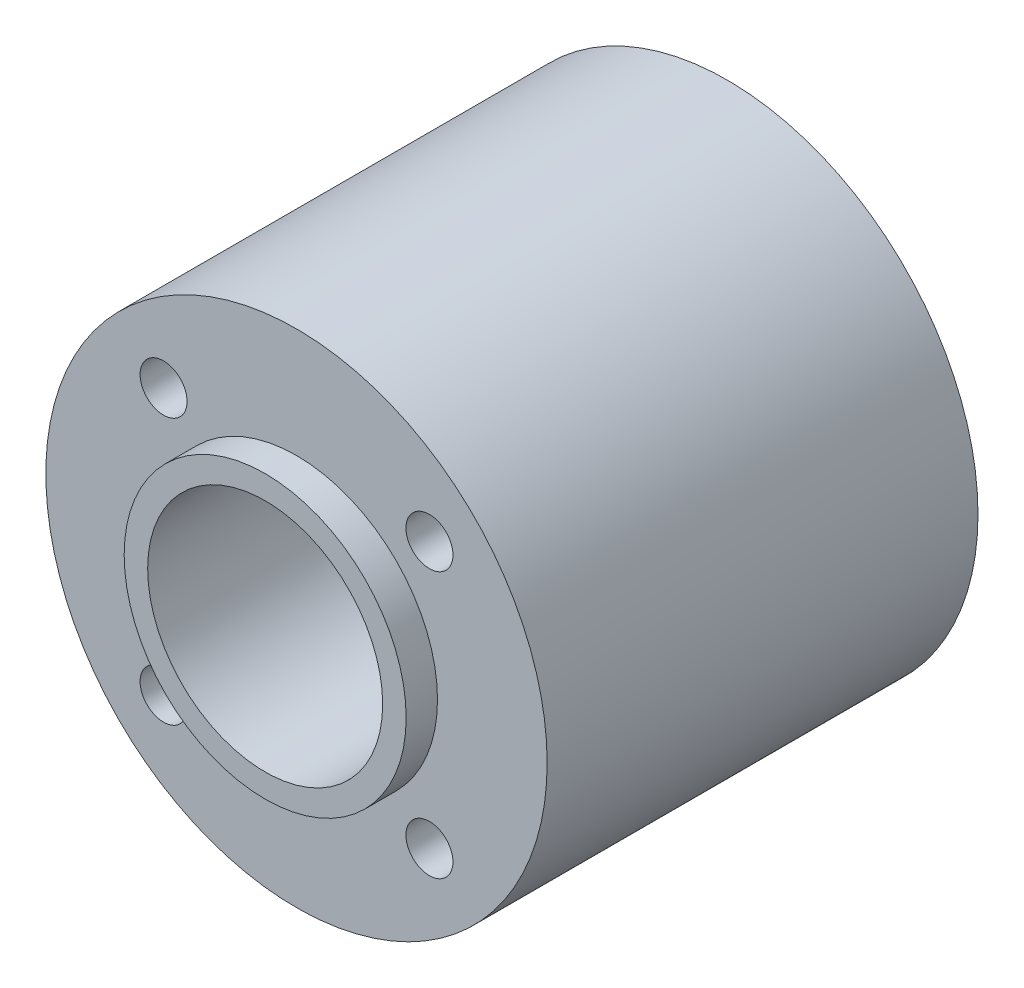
ISO-10303-21;
HEADER;
FILE_DESCRIPTION(('STEP AP214'),'2;1');
FILE_NAME('part.step','',(''),(''),'','','');
FILE_SCHEMA(('AUTOMOTIVE_DESIGN { 1 0 10303 214 1 1 1 1 }'));
ENDSEC;
DATA;
#1=APPLICATION_CONTEXT('core data for automotive mechanical design processes');
#2=APPLICATION_PROTOCOL_DEFINITION('international standard','automotive_design',2000,#1);
#3=PRODUCT_CONTEXT('',#1,'mechanical');
#4=PRODUCT('Part','Part','',(#3));
#5=PRODUCT_RELATED_PRODUCT_CATEGORY('part','',(#4));
#6=PRODUCT_DEFINITION_FORMATION('','',#4);
#7=PRODUCT_DEFINITION_CONTEXT('part definition',#1,'design');
#8=PRODUCT_DEFINITION('design','',#6,#7);
#9=PRODUCT_DEFINITION_SHAPE('','',#8);
#10=(LENGTH_UNIT() NAMED_UNIT(*) SI_UNIT(.MILLI.,.METRE.));
#11=(NAMED_UNIT(*) PLANE_ANGLE_UNIT() SI_UNIT($,.RADIAN.));
#12=(NAMED_UNIT(*) SI_UNIT($,.STERADIAN.) SOLID_ANGLE_UNIT());
#13=UNCERTAINTY_MEASURE_WITH_UNIT(LENGTH_MEASURE(1.E-05),#10,'distance_accuracy_value','');
#14=(GEOMETRIC_REPRESENTATION_CONTEXT(3) GLOBAL_UNCERTAINTY_ASSIGNED_CONTEXT((#13)) GLOBAL_UNIT_ASSIGNED_CONTEXT((#10,
#11,#12)) REPRESENTATION_CONTEXT('',''));
#15=CARTESIAN_POINT('',(0.,0.,0.));
#16=DIRECTION('',(0.,0.,1.));
#17=DIRECTION('',(1.,0.,0.));
#18=AXIS2_PLACEMENT_3D('',#15,#16,#17);
#19=CARTESIAN_POINT('',(0.,0.,13.75));
#20=DIRECTION('',(0.,0.,1.));
#21=DIRECTION('',(1.,0.,0.));
#22=AXIS2_PLACEMENT_3D('',#19,#20,#21);
#23=PLANE('',#22);
#24=CARTESIAN_POINT('',(0.,0.,13.75));
#25=DIRECTION('',(0.,0.,1.));
#26=DIRECTION('',(1.,0.,0.));
#27=AXIS2_PLACEMENT_3D('',#24,#25,#26);
#28=CIRCLE('',#27,16.);
#29=CARTESIAN_POINT('',(16.,0.,13.75));
#30=VERTEX_POINT('',#29);
#31=EDGE_CURVE('E11',#30,#30,#28,.T.);
#32=ORIENTED_EDGE('',*,*,#31,.T.);
#33=EDGE_LOOP('',(#32));
#34=FACE_BOUND('',#33,.T.);
#35=CARTESIAN_POINT('',(-8.48528137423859,8.48528137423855,13.75));
#36=DIRECTION('',(0.,0.,1.));
#37=DIRECTION('',(1.,0.,0.));
#38=AXIS2_PLACEMENT_3D('',#35,#36,#37);
#39=CIRCLE('',#38,1.5);
#40=CARTESIAN_POINT('',(-6.98528137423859,8.48528137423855,13.75));
#41=VERTEX_POINT('',#40);
#42=EDGE_CURVE('E64',#41,#41,#39,.T.);
#43=ORIENTED_EDGE('',*,*,#42,.F.);
#44=EDGE_LOOP('',(#43));
#45=FACE_BOUND('',#44,.T.);
#46=CARTESIAN_POINT('',(8.48528137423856,8.48528137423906,13.75));
#47=DIRECTION('',(0.,0.,1.));
#48=DIRECTION('',(1.,0.,0.));
#49=AXIS2_PLACEMENT_3D('',#46,#47,#48);
#50=CIRCLE('',#49,1.50000000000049);
#51=CARTESIAN_POINT('',(9.98528137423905,8.48528137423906,13.75));
#52=VERTEX_POINT('',#51);
#53=EDGE_CURVE('E89',#52,#52,#50,.T.);
#54=ORIENTED_EDGE('',*,*,#53,.F.);
#55=EDGE_LOOP('',(#54));
#56=FACE_BOUND('',#55,.T.);
#57=CARTESIAN_POINT('',(8.48528137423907,-8.48528137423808,13.75));
#58=DIRECTION('',(0.,0.,1.));
#59=DIRECTION('',(1.,0.,0.));
#60=AXIS2_PLACEMENT_3D('',#57,#58,#59);
#61=CIRCLE('',#60,1.50000000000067);
#62=CARTESIAN_POINT('',(9.98528137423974,-8.48528137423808,13.75));
#63=VERTEX_POINT('',#62);
#64=EDGE_CURVE('E81',#63,#63,#61,.T.);
#65=ORIENTED_EDGE('',*,*,#64,.F.);
#66=EDGE_LOOP('',(#65));
#67=FACE_BOUND('',#66,.T.);
#68=CARTESIAN_POINT('',(-8.48528137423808,-8.48528137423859,13.75));
#69=DIRECTION('',(0.,0.,1.));
#70=DIRECTION('',(1.,0.,0.));
#71=AXIS2_PLACEMENT_3D('',#68,#69,#70);
#72=CIRCLE('',#71,1.50000000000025);
#73=CARTESIAN_POINT('',(-6.98528137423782,-8.48528137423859,13.75));
#74=VERTEX_POINT('',#73);
#75=EDGE_CURVE('E72',#74,#74,#72,.T.);
#76=ORIENTED_EDGE('',*,*,#75,.F.);
#77=EDGE_LOOP('',(#76));
#78=FACE_BOUND('',#77,.T.);
#79=CARTESIAN_POINT('',(0.,0.,13.75));
#80=DIRECTION('',(0.,0.,1.));
#81=DIRECTION('',(1.,0.,0.));
#82=AXIS2_PLACEMENT_3D('',#79,#80,#81);
#83=CIRCLE('',#82,9.);
#84=CARTESIAN_POINT('',(9.,0.,13.75));
#85=VERTEX_POINT('',#84);
#86=EDGE_CURVE('E96',#85,#85,#83,.T.);
#87=ORIENTED_EDGE('',*,*,#86,.F.);
#88=EDGE_LOOP('',(#87));
#89=FACE_BOUND('',#88,.T.);
#90=ADVANCED_FACE('F49',(#34,#45,#56,#67,#78,#89),#23,.T.);
#91=CARTESIAN_POINT('',(0.,0.,13.75));
#92=DIRECTION('',(0.,0.,-1.));
#93=DIRECTION('',(-1.,0.,0.));
#94=AXIS2_PLACEMENT_3D('',#91,#92,#93);
#95=CYLINDRICAL_SURFACE('',#94,16.);
#96=ORIENTED_EDGE('',*,*,#31,.F.);
#97=EDGE_LOOP('',(#96));
#98=FACE_BOUND('',#97,.T.);
#99=CARTESIAN_POINT('',(0.,0.,-13.75));
#100=DIRECTION('',(0.,0.,1.));
#101=DIRECTION('',(1.,0.,0.));
#102=AXIS2_PLACEMENT_3D('',#99,#100,#101);
#103=CIRCLE('',#102,16.);
#104=CARTESIAN_POINT('',(16.,0.,-13.75));
#105=VERTEX_POINT('',#104);
#106=EDGE_CURVE('E53',#105,#105,#103,.T.);
#107=ORIENTED_EDGE('',*,*,#106,.T.);
#108=EDGE_LOOP('',(#107));
#109=FACE_BOUND('',#108,.T.);
#110=ADVANCED_FACE('F51',(#98,#109),#95,.T.);
#111=CARTESIAN_POINT('',(0.,0.,-13.75));
#112=DIRECTION('',(0.,0.,1.));
#113=DIRECTION('',(1.,0.,0.));
#114=AXIS2_PLACEMENT_3D('',#111,#112,#113);
#115=PLANE('',#114);
#116=CARTESIAN_POINT('',(0.,0.,-13.75));
#117=DIRECTION('',(0.,0.,1.));
#118=DIRECTION('',(1.,0.,0.));
#119=AXIS2_PLACEMENT_3D('',#116,#117,#118);
#120=CIRCLE('',#119,9.);
#121=CARTESIAN_POINT('',(9.,0.,-13.75));
#122=VERTEX_POINT('',#121);
#123=EDGE_CURVE('E108',#122,#122,#120,.T.);
#124=ORIENTED_EDGE('',*,*,#123,.T.);
#125=EDGE_LOOP('',(#124));
#126=FACE_BOUND('',#125,.T.);
#127=CARTESIAN_POINT('',(-8.48528137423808,-8.48528137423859,-13.75));
#128=DIRECTION('',(0.,0.,1.));
#129=DIRECTION('',(1.,0.,0.));
#130=AXIS2_PLACEMENT_3D('',#127,#128,#129);
#131=CIRCLE('',#130,1.50000000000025);
#132=CARTESIAN_POINT('',(-6.98528137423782,-8.48528137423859,-13.75));
#133=VERTEX_POINT('',#132);
#134=EDGE_CURVE('E76',#133,#133,#131,.T.);
#135=ORIENTED_EDGE('',*,*,#134,.T.);
#136=EDGE_LOOP('',(#135));
#137=FACE_BOUND('',#136,.T.);
#138=CARTESIAN_POINT('',(8.48528137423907,-8.48528137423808,-13.75));
#139=DIRECTION('',(0.,0.,1.));
#140=DIRECTION('',(1.,0.,0.));
#141=AXIS2_PLACEMENT_3D('',#138,#139,#140);
#142=CIRCLE('',#141,1.50000000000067);
#143=CARTESIAN_POINT('',(9.98528137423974,-8.48528137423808,-13.75));
#144=VERTEX_POINT('',#143);
#145=EDGE_CURVE('E85',#144,#144,#142,.T.);
#146=ORIENTED_EDGE('',*,*,#145,.T.);
#147=EDGE_LOOP('',(#146));
#148=FACE_BOUND('',#147,.T.);
#149=CARTESIAN_POINT('',(8.48528137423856,8.48528137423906,-13.75));
#150=DIRECTION('',(0.,0.,1.));
#151=DIRECTION('',(1.,0.,0.));
#152=AXIS2_PLACEMENT_3D('',#149,#150,#151);
#153=CIRCLE('',#152,1.50000000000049);
#154=CARTESIAN_POINT('',(9.98528137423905,8.48528137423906,-13.75));
#155=VERTEX_POINT('',#154);
#156=EDGE_CURVE('E68',#155,#155,#153,.T.);
#157=ORIENTED_EDGE('',*,*,#156,.T.);
#158=EDGE_LOOP('',(#157));
#159=FACE_BOUND('',#158,.T.);
#160=CARTESIAN_POINT('',(-8.48528137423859,8.48528137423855,-13.75));
#161=DIRECTION('',(0.,0.,1.));
#162=DIRECTION('',(1.,0.,0.));
#163=AXIS2_PLACEMENT_3D('',#160,#161,#162);
#164=CIRCLE('',#163,1.5);
#165=CARTESIAN_POINT('',(-6.98528137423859,8.48528137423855,-13.75));
#166=VERTEX_POINT('',#165);
#167=EDGE_CURVE('E62',#166,#166,#164,.T.);
#168=ORIENTED_EDGE('',*,*,#167,.T.);
#169=EDGE_LOOP('',(#168));
#170=FACE_BOUND('',#169,.T.);
#171=ORIENTED_EDGE('',*,*,#106,.F.);
#172=EDGE_LOOP('',(#171));
#173=FACE_BOUND('',#172,.T.);
#174=ADVANCED_FACE('F146',(#126,#137,#148,#159,#170,#173),#115,.F.);
#175=CARTESIAN_POINT('',(-8.48528137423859,8.48528137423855,-13.75));
#176=DIRECTION('',(0.,0.,1.));
#177=DIRECTION('',(1.,0.,0.));
#178=AXIS2_PLACEMENT_3D('',#175,#176,#177);
#179=CYLINDRICAL_SURFACE('',#178,1.5);
#180=ORIENTED_EDGE('',*,*,#167,.F.);
#181=EDGE_LOOP('',(#180));
#182=FACE_BOUND('',#181,.T.);
#183=ORIENTED_EDGE('',*,*,#42,.T.);
#184=EDGE_LOOP('',(#183));
#185=FACE_BOUND('',#184,.T.);
#186=ADVANCED_FACE('F150',(#182,#185),#179,.F.);
#187=CARTESIAN_POINT('',(8.48528137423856,8.48528137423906,-13.75));
#188=DIRECTION('',(0.,0.,1.));
#189=DIRECTION('',(1.,0.,0.));
#190=AXIS2_PLACEMENT_3D('',#187,#188,#189);
#191=CYLINDRICAL_SURFACE('',#190,1.50000000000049);
#192=ORIENTED_EDGE('',*,*,#156,.F.);
#193=EDGE_LOOP('',(#192));
#194=FACE_BOUND('',#193,.T.);
#195=ORIENTED_EDGE('',*,*,#53,.T.);
#196=EDGE_LOOP('',(#195));
#197=FACE_BOUND('',#196,.T.);
#198=ADVANCED_FACE('F156',(#194,#197),#191,.F.);
#199=CARTESIAN_POINT('',(8.48528137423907,-8.48528137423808,-13.75));
#200=DIRECTION('',(0.,0.,1.));
#201=DIRECTION('',(1.,0.,0.));
#202=AXIS2_PLACEMENT_3D('',#199,#200,#201);
#203=CYLINDRICAL_SURFACE('',#202,1.50000000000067);
#204=ORIENTED_EDGE('',*,*,#145,.F.);
#205=EDGE_LOOP('',(#204));
#206=FACE_BOUND('',#205,.T.);
#207=ORIENTED_EDGE('',*,*,#64,.T.);
#208=EDGE_LOOP('',(#207));
#209=FACE_BOUND('',#208,.T.);
#210=ADVANCED_FACE('F136',(#206,#209),#203,.F.);
#211=CARTESIAN_POINT('',(-8.48528137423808,-8.48528137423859,-13.75));
#212=DIRECTION('',(0.,0.,1.));
#213=DIRECTION('',(1.,0.,0.));
#214=AXIS2_PLACEMENT_3D('',#211,#212,#213);
#215=CYLINDRICAL_SURFACE('',#214,1.50000000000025);
#216=ORIENTED_EDGE('',*,*,#134,.F.);
#217=EDGE_LOOP('',(#216));
#218=FACE_BOUND('',#217,.T.);
#219=ORIENTED_EDGE('',*,*,#75,.T.);
#220=EDGE_LOOP('',(#219));
#221=FACE_BOUND('',#220,.T.);
#222=ADVANCED_FACE('F126',(#218,#221),#215,.F.);
#223=CARTESIAN_POINT('',(0.,0.,-13.75));
#224=DIRECTION('',(0.,0.,1.));
#225=DIRECTION('',(1.,0.,0.));
#226=AXIS2_PLACEMENT_3D('',#223,#224,#225);
#227=CYLINDRICAL_SURFACE('',#226,7.5);
#228=CARTESIAN_POINT('',(0.,0.,15.75));
#229=DIRECTION('',(0.,0.,1.));
#230=DIRECTION('',(1.,0.,0.));
#231=AXIS2_PLACEMENT_3D('',#228,#229,#230);
#232=CIRCLE('',#231,7.5);
#233=CARTESIAN_POINT('',(7.5,0.,15.75));
#234=VERTEX_POINT('',#233);
#235=EDGE_CURVE('E100',#234,#234,#232,.T.);
#236=ORIENTED_EDGE('',*,*,#235,.T.);
#237=EDGE_LOOP('',(#236));
#238=FACE_BOUND('',#237,.T.);
#239=CARTESIAN_POINT('',(0.,0.,-15.75));
#240=DIRECTION('',(0.,0.,1.));
#241=DIRECTION('',(1.,0.,0.));
#242=AXIS2_PLACEMENT_3D('',#239,#240,#241);
#243=CIRCLE('',#242,7.5);
#244=CARTESIAN_POINT('',(7.5,0.,-15.75));
#245=VERTEX_POINT('',#244);
#246=EDGE_CURVE('E112',#245,#245,#243,.T.);
#247=ORIENTED_EDGE('',*,*,#246,.F.);
#248=EDGE_LOOP('',(#247));
#249=FACE_BOUND('',#248,.T.);
#250=ADVANCED_FACE('F123',(#238,#249),#227,.F.);
#251=CARTESIAN_POINT('',(0.,0.,15.75));
#252=DIRECTION('',(0.,0.,1.));
#253=DIRECTION('',(1.,0.,0.));
#254=AXIS2_PLACEMENT_3D('',#251,#252,#253);
#255=PLANE('',#254);
#256=CARTESIAN_POINT('',(0.,0.,15.75));
#257=DIRECTION('',(0.,0.,1.));
#258=DIRECTION('',(1.,0.,0.));
#259=AXIS2_PLACEMENT_3D('',#256,#257,#258);
#260=CIRCLE('',#259,9.);
#261=CARTESIAN_POINT('',(9.,0.,15.75));
#262=VERTEX_POINT('',#261);
#263=EDGE_CURVE('E77',#262,#262,#260,.T.);
#264=ORIENTED_EDGE('',*,*,#263,.T.);
#265=EDGE_LOOP('',(#264));
#266=FACE_BOUND('',#265,.T.);
#267=ORIENTED_EDGE('',*,*,#235,.F.);
#268=EDGE_LOOP('',(#267));
#269=FACE_BOUND('',#268,.T.);
#270=ADVANCED_FACE('F125',(#266,#269),#255,.T.);
#271=CARTESIAN_POINT('',(0.,0.,15.75));
#272=DIRECTION('',(0.,0.,-1.));
#273=DIRECTION('',(-1.,0.,0.));
#274=AXIS2_PLACEMENT_3D('',#271,#272,#273);
#275=CYLINDRICAL_SURFACE('',#274,9.);
#276=ORIENTED_EDGE('',*,*,#263,.F.);
#277=EDGE_LOOP('',(#276));
#278=FACE_BOUND('',#277,.T.);
#279=ORIENTED_EDGE('',*,*,#86,.T.);
#280=EDGE_LOOP('',(#279));
#281=FACE_BOUND('',#280,.T.);
#282=ADVANCED_FACE('F133',(#278,#281),#275,.T.);
#283=CARTESIAN_POINT('',(0.,0.,-15.75));
#284=DIRECTION('',(0.,0.,1.));
#285=DIRECTION('',(1.,0.,0.));
#286=AXIS2_PLACEMENT_3D('',#283,#284,#285);
#287=CYLINDRICAL_SURFACE('',#286,9.);
#288=CARTESIAN_POINT('',(0.,0.,-15.75));
#289=DIRECTION('',(0.,0.,1.));
#290=DIRECTION('',(1.,0.,0.));
#291=AXIS2_PLACEMENT_3D('',#288,#289,#290);
#292=CIRCLE('',#291,9.);
#293=CARTESIAN_POINT('',(9.,0.,-15.75));
#294=VERTEX_POINT('',#293);
#295=EDGE_CURVE('E107',#294,#294,#292,.T.);
#296=ORIENTED_EDGE('',*,*,#295,.T.);
#297=EDGE_LOOP('',(#296));
#298=FACE_BOUND('',#297,.T.);
#299=ORIENTED_EDGE('',*,*,#123,.F.);
#300=EDGE_LOOP('',(#299));
#301=FACE_BOUND('',#300,.T.);
#302=ADVANCED_FACE('F182',(#298,#301),#287,.T.);
#303=CARTESIAN_POINT('',(0.,0.,-15.75));
#304=DIRECTION('',(0.,0.,-1.));
#305=DIRECTION('',(1.,0.,0.));
#306=AXIS2_PLACEMENT_3D('',#303,#304,#305);
#307=PLANE('',#306);
#308=ORIENTED_EDGE('',*,*,#246,.T.);
#309=EDGE_LOOP('',(#308));
#310=FACE_BOUND('',#309,.T.);
#311=ORIENTED_EDGE('',*,*,#295,.F.);
#312=EDGE_LOOP('',(#311));
#313=FACE_BOUND('',#312,.T.);
#314=ADVANCED_FACE('F120',(#310,#313),#307,.T.);
#315=CLOSED_SHELL('',(#90,#110,#174,#186,#198,#210,#222,#250,#270,#282,#302,#314));
#316=MANIFOLD_SOLID_BREP('B2',#315);
#317=ADVANCED_BREP_SHAPE_REPRESENTATION('',(#18,#316),#14);
#318=SHAPE_DEFINITION_REPRESENTATION(#9,#317);
ENDSEC;
END-ISO-10303-21;
